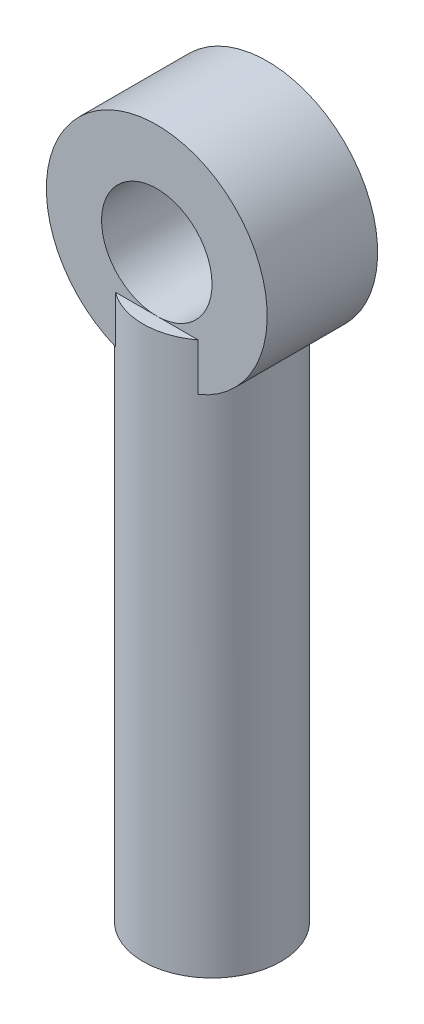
ISO-10303-21;
HEADER;
FILE_DESCRIPTION(('STEP AP214'),'2;1');
FILE_NAME('part.step','',(''),(''),'','','');
FILE_SCHEMA(('AUTOMOTIVE_DESIGN { 1 0 10303 214 1 1 1 1 }'));
ENDSEC;
DATA;
#1=APPLICATION_CONTEXT('core data for automotive mechanical design processes');
#2=APPLICATION_PROTOCOL_DEFINITION('international standard','automotive_design',2000,#1);
#3=PRODUCT_CONTEXT('',#1,'mechanical');
#4=PRODUCT('Part','Part','',(#3));
#5=PRODUCT_RELATED_PRODUCT_CATEGORY('part','',(#4));
#6=PRODUCT_DEFINITION_FORMATION('','',#4);
#7=PRODUCT_DEFINITION_CONTEXT('part definition',#1,'design');
#8=PRODUCT_DEFINITION('design','',#6,#7);
#9=PRODUCT_DEFINITION_SHAPE('','',#8);
#10=(LENGTH_UNIT() NAMED_UNIT(*) SI_UNIT(.MILLI.,.METRE.));
#11=(NAMED_UNIT(*) PLANE_ANGLE_UNIT() SI_UNIT($,.RADIAN.));
#12=(NAMED_UNIT(*) SI_UNIT($,.STERADIAN.) SOLID_ANGLE_UNIT());
#13=UNCERTAINTY_MEASURE_WITH_UNIT(LENGTH_MEASURE(1.E-05),#10,'distance_accuracy_value','');
#14=(GEOMETRIC_REPRESENTATION_CONTEXT(3) GLOBAL_UNCERTAINTY_ASSIGNED_CONTEXT((#13)) GLOBAL_UNIT_ASSIGNED_CONTEXT((#10,
#11,#12)) REPRESENTATION_CONTEXT('',''));
#15=CARTESIAN_POINT('',(0.,0.,0.));
#16=DIRECTION('',(0.,0.,1.));
#17=DIRECTION('',(1.,0.,0.));
#18=AXIS2_PLACEMENT_3D('',#15,#16,#17);
#19=CARTESIAN_POINT('',(0.,12.7,0.));
#20=DIRECTION('',(0.,1.,0.));
#21=DIRECTION('',(0.,0.,1.));
#22=AXIS2_PLACEMENT_3D('',#19,#20,#21);
#23=PLANE('',#22);
#24=CARTESIAN_POINT('',(0.,12.7,0.));
#25=DIRECTION('',(0.,1.,0.));
#26=DIRECTION('',(0.,0.,1.));
#27=AXIS2_PLACEMENT_3D('',#24,#25,#26);
#28=CIRCLE('',#27,1.5875);
#29=CARTESIAN_POINT('',(0.952500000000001,12.7,-1.27));
#30=VERTEX_POINT('',#29);
#31=CARTESIAN_POINT('',(-0.952500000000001,12.7,-1.27));
#32=VERTEX_POINT('',#31);
#33=EDGE_CURVE('E121',#30,#32,#28,.T.);
#34=ORIENTED_EDGE('',*,*,#33,.T.);
#35=DIRECTION('',(1.,0.,0.));
#36=VECTOR('',#35,1.);
#37=CARTESIAN_POINT('',(0.,12.7,-1.27));
#38=LINE('',#37,#36);
#39=CARTESIAN_POINT('',(0.,12.7,-1.27));
#40=VERTEX_POINT('',#39);
#41=EDGE_CURVE('E93',#32,#40,#38,.T.);
#42=ORIENTED_EDGE('',*,*,#41,.T.);
#43=EDGE_CURVE('E122',#40,#30,#38,.T.);
#44=ORIENTED_EDGE('',*,*,#43,.T.);
#45=EDGE_LOOP('',(#34,#42,#44));
#46=FACE_BOUND('',#45,.T.);
#47=ADVANCED_FACE('F34',(#46),#23,.T.);
#48=CARTESIAN_POINT('',(0.,12.7,0.));
#49=DIRECTION('',(0.,-1.,0.));
#50=DIRECTION('',(0.,0.,-1.));
#51=AXIS2_PLACEMENT_3D('',#48,#49,#50);
#52=CYLINDRICAL_SURFACE('',#51,1.5875);
#53=CARTESIAN_POINT('',(0.952500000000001,11.6153569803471,1.27));
#54=CARTESIAN_POINT('',(0.989655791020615,11.6303856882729,1.2421256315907));
#55=CARTESIAN_POINT('',(1.02544534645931,11.6458888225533,1.21274252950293));
#56=CARTESIAN_POINT('',(1.09419094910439,11.6774519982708,1.15110327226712));
#57=CARTESIAN_POINT('',(1.12714713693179,11.6935120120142,1.11884725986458));
#58=CARTESIAN_POINT('',(1.22215858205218,11.7422182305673,1.01740645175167));
#59=CARTESIAN_POINT('',(1.27971680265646,11.7751199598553,0.944030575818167));
#60=CARTESIAN_POINT('',(1.38170319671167,11.8378436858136,0.787289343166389));
#61=CARTESIAN_POINT('',(1.42610923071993,11.8676604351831,0.703907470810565));
#62=CARTESIAN_POINT('',(1.49983096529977,11.9195966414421,0.528772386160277));
#63=CARTESIAN_POINT('',(1.52921852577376,11.9417525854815,0.437061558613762));
#64=CARTESIAN_POINT('',(1.56528116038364,11.9695348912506,0.273853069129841));
#65=CARTESIAN_POINT('',(1.57597885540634,11.9780307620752,0.203728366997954));
#66=CARTESIAN_POINT('',(1.58786748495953,11.9874911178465,0.0621688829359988));
#67=CARTESIAN_POINT('',(1.5890636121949,11.9884597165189,-0.00926516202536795));
#68=CARTESIAN_POINT('',(1.58187506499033,11.9827183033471,-0.151274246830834));
#69=CARTESIAN_POINT('',(1.57349588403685,11.9760126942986,-0.221849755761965));
#70=CARTESIAN_POINT('',(1.54767109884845,11.9559058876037,-0.360337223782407));
#71=CARTESIAN_POINT('',(1.53021845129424,11.9424994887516,-0.428247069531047));
#72=CARTESIAN_POINT('',(1.48616804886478,11.9099813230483,-0.562735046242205));
#73=CARTESIAN_POINT('',(1.45923066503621,11.8906617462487,-0.629149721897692));
#74=CARTESIAN_POINT('',(1.39724824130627,11.8485135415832,-0.756907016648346));
#75=CARTESIAN_POINT('',(1.36219388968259,11.8256808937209,-0.818243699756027));
#76=CARTESIAN_POINT('',(1.27324561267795,11.7713904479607,-0.952491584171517));
#77=CARTESIAN_POINT('',(1.21684063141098,11.7393644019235,-1.02353478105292));
#78=CARTESIAN_POINT('',(1.12383524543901,11.6918843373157,-1.12213659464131));
#79=CARTESIAN_POINT('',(1.09145737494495,11.6761607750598,-1.15365893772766));
#80=CARTESIAN_POINT('',(1.0239904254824,11.6452592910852,-1.21393596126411));
#81=CARTESIAN_POINT('',(0.988901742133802,11.6300812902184,-1.2426910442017));
#82=CARTESIAN_POINT('',(0.952500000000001,11.6153569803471,-1.27));
#83=B_SPLINE_CURVE_WITH_KNOTS('',3,(#53,#54,#55,#56,#57,#58,#59,#60,#61,#62,#63,#64,#65,#66,#67,
#68,#69,#70,#71,#72,#73,#74,#75,#76,#77,#78,#79,#80,#81,#82),.UNSPECIFIED.,.F.,.F.,(4,2,2,2,2,2,
2,2,2,2,2,2,2,2,4),(0.,0.146355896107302,0.292704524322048,0.587907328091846,0.883604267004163,
1.1778727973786,1.39125693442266,1.60452444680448,1.81766966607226,2.03098058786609,
2.25287211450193,2.47501946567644,2.76219802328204,2.90560249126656,3.04898606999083),.UNSPECIFIED.);
#84=CARTESIAN_POINT('',(0.952500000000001,11.6153569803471,1.27));
#85=VERTEX_POINT('',#84);
#86=CARTESIAN_POINT('',(0.952500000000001,11.6153569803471,-1.27));
#87=VERTEX_POINT('',#86);
#88=EDGE_CURVE('E11',#85,#87,#83,.T.);
#89=ORIENTED_EDGE('',*,*,#88,.F.);
#90=DIRECTION('',(0.,-1.,0.));
#91=VECTOR('',#90,1.);
#92=CARTESIAN_POINT('',(0.952500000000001,12.7,1.27));
#93=LINE('',#92,#91);
#94=CARTESIAN_POINT('',(0.952500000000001,12.7,1.27));
#95=VERTEX_POINT('',#94);
#96=EDGE_CURVE('E112',#85,#95,#93,.F.);
#97=ORIENTED_EDGE('',*,*,#96,.T.);
#98=CARTESIAN_POINT('',(-0.952500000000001,12.7,1.27));
#99=VERTEX_POINT('',#98);
#100=EDGE_CURVE('E119',#99,#95,#28,.T.);
#101=ORIENTED_EDGE('',*,*,#100,.F.);
#102=DIRECTION('',(0.,-1.,0.));
#103=VECTOR('',#102,1.);
#104=CARTESIAN_POINT('',(-0.952500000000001,12.7,1.27));
#105=LINE('',#104,#103);
#106=CARTESIAN_POINT('',(-0.952500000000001,11.6153569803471,1.27));
#107=VERTEX_POINT('',#106);
#108=EDGE_CURVE('E62',#99,#107,#105,.T.);
#109=ORIENTED_EDGE('',*,*,#108,.T.);
#110=CARTESIAN_POINT('',(-0.952500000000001,11.6153569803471,-1.27));
#111=CARTESIAN_POINT('',(-0.989655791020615,11.6303856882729,-1.2421256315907));
#112=CARTESIAN_POINT('',(-1.02544534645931,11.6458888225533,-1.21274252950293));
#113=CARTESIAN_POINT('',(-1.09419094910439,11.6774519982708,-1.15110327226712));
#114=CARTESIAN_POINT('',(-1.12714713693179,11.6935120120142,-1.11884725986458));
#115=CARTESIAN_POINT('',(-1.22215858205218,11.7422182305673,-1.01740645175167));
#116=CARTESIAN_POINT('',(-1.27971680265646,11.7751199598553,-0.944030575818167));
#117=CARTESIAN_POINT('',(-1.38170319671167,11.8378436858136,-0.787289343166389));
#118=CARTESIAN_POINT('',(-1.42610923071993,11.8676604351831,-0.703907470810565));
#119=CARTESIAN_POINT('',(-1.49983096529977,11.9195966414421,-0.528772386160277));
#120=CARTESIAN_POINT('',(-1.52921852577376,11.9417525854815,-0.437061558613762));
#121=CARTESIAN_POINT('',(-1.56528116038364,11.9695348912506,-0.273853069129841));
#122=CARTESIAN_POINT('',(-1.57597885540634,11.9780307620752,-0.203728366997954));
#123=CARTESIAN_POINT('',(-1.58786748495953,11.9874911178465,-0.0621688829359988));
#124=CARTESIAN_POINT('',(-1.5890636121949,11.9884597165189,0.00926516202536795));
#125=CARTESIAN_POINT('',(-1.58187506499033,11.9827183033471,0.151274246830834));
#126=CARTESIAN_POINT('',(-1.57349588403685,11.9760126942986,0.221849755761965));
#127=CARTESIAN_POINT('',(-1.54767109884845,11.9559058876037,0.360337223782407));
#128=CARTESIAN_POINT('',(-1.53021845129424,11.9424994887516,0.428247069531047));
#129=CARTESIAN_POINT('',(-1.48616804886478,11.9099813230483,0.562735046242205));
#130=CARTESIAN_POINT('',(-1.45923066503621,11.8906617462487,0.629149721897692));
#131=CARTESIAN_POINT('',(-1.39724824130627,11.8485135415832,0.756907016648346));
#132=CARTESIAN_POINT('',(-1.36219388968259,11.8256808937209,0.818243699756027));
#133=CARTESIAN_POINT('',(-1.27324561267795,11.7713904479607,0.952491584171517));
#134=CARTESIAN_POINT('',(-1.21684063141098,11.7393644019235,1.02353478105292));
#135=CARTESIAN_POINT('',(-1.12383524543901,11.6918843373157,1.12213659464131));
#136=CARTESIAN_POINT('',(-1.09145737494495,11.6761607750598,1.15365893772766));
#137=CARTESIAN_POINT('',(-1.0239904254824,11.6452592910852,1.21393596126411));
#138=CARTESIAN_POINT('',(-0.988901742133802,11.6300812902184,1.2426910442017));
#139=CARTESIAN_POINT('',(-0.952500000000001,11.6153569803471,1.27));
#140=B_SPLINE_CURVE_WITH_KNOTS('',3,(#110,#111,#112,#113,#114,#115,#116,#117,#118,#119,#120,
#121,#122,#123,#124,#125,#126,#127,#128,#129,#130,#131,#132,#133,#134,#135,#136,#137,#138,#139),
.UNSPECIFIED.,.F.,.F.,(4,2,2,2,2,2,2,2,2,2,2,2,2,2,4),(0.,0.146355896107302,0.292704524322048,
0.587907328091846,0.883604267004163,1.1778727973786,1.39125693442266,1.60452444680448,
1.81766966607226,2.03098058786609,2.25287211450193,2.47501946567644,2.76219802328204,
2.90560249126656,3.04898606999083),.UNSPECIFIED.);
#141=CARTESIAN_POINT('',(-0.952500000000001,11.6153569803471,-1.27));
#142=VERTEX_POINT('',#141);
#143=EDGE_CURVE('E47',#142,#107,#140,.T.);
#144=ORIENTED_EDGE('',*,*,#143,.F.);
#145=DIRECTION('',(0.,-1.,0.));
#146=VECTOR('',#145,1.);
#147=CARTESIAN_POINT('',(-0.952500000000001,12.7,-1.27));
#148=LINE('',#147,#146);
#149=EDGE_CURVE('E110',#32,#142,#148,.T.);
#150=ORIENTED_EDGE('',*,*,#149,.F.);
#151=ORIENTED_EDGE('',*,*,#33,.F.);
#152=DIRECTION('',(0.,-1.,0.));
#153=VECTOR('',#152,1.);
#154=CARTESIAN_POINT('',(0.952500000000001,12.7,-1.27));
#155=LINE('',#154,#153);
#156=EDGE_CURVE('E54',#87,#30,#155,.F.);
#157=ORIENTED_EDGE('',*,*,#156,.F.);
#158=EDGE_LOOP('',(#89,#97,#101,#109,#144,#150,#151,#157));
#159=FACE_BOUND('',#158,.T.);
#160=CARTESIAN_POINT('',(0.,0.,0.));
#161=DIRECTION('',(0.,1.,0.));
#162=DIRECTION('',(0.,0.,1.));
#163=AXIS2_PLACEMENT_3D('',#160,#161,#162);
#164=CIRCLE('',#163,1.5875);
#165=CARTESIAN_POINT('',(0.,0.,1.5875));
#166=VERTEX_POINT('',#165);
#167=EDGE_CURVE('E116',#166,#166,#164,.T.);
#168=ORIENTED_EDGE('',*,*,#167,.T.);
#169=EDGE_LOOP('',(#168));
#170=FACE_BOUND('',#169,.T.);
#171=ADVANCED_FACE('F36',(#159,#170),#52,.T.);
#172=DIRECTION('',(1.,0.,0.));
#173=VECTOR('',#172,1.);
#174=CARTESIAN_POINT('',(0.,12.7,1.27));
#175=LINE('',#174,#173);
#176=CARTESIAN_POINT('',(0.,12.7,1.27));
#177=VERTEX_POINT('',#176);
#178=EDGE_CURVE('E85',#99,#177,#175,.T.);
#179=ORIENTED_EDGE('',*,*,#178,.F.);
#180=ORIENTED_EDGE('',*,*,#100,.T.);
#181=EDGE_CURVE('E95',#177,#95,#175,.T.);
#182=ORIENTED_EDGE('',*,*,#181,.F.);
#183=EDGE_LOOP('',(#179,#180,#182));
#184=FACE_BOUND('',#183,.T.);
#185=ADVANCED_FACE('F136',(#184),#23,.T.);
#186=CARTESIAN_POINT('',(0.,0.,0.));
#187=DIRECTION('',(0.,1.,0.));
#188=DIRECTION('',(0.,0.,1.));
#189=AXIS2_PLACEMENT_3D('',#186,#187,#188);
#190=PLANE('',#189);
#191=ORIENTED_EDGE('',*,*,#167,.F.);
#192=EDGE_LOOP('',(#191));
#193=FACE_BOUND('',#192,.T.);
#194=ADVANCED_FACE('F131',(#193),#190,.F.);
#195=CARTESIAN_POINT('',(0.,13.97,1.27));
#196=DIRECTION('',(0.,0.,-1.));
#197=DIRECTION('',(-1.,0.,0.));
#198=AXIS2_PLACEMENT_3D('',#195,#196,#197);
#199=CYLINDRICAL_SURFACE('',#198,2.54);
#200=CARTESIAN_POINT('',(0.,13.97,1.27));
#201=DIRECTION('',(0.,0.,1.));
#202=DIRECTION('',(1.,0.,0.));
#203=AXIS2_PLACEMENT_3D('',#200,#201,#202);
#204=CIRCLE('',#203,2.54);
#205=EDGE_CURVE('E103',#85,#107,#204,.T.);
#206=ORIENTED_EDGE('',*,*,#205,.F.);
#207=ORIENTED_EDGE('',*,*,#88,.T.);
#208=CARTESIAN_POINT('',(0.,13.97,-1.27));
#209=DIRECTION('',(0.,0.,1.));
#210=DIRECTION('',(1.,0.,0.));
#211=AXIS2_PLACEMENT_3D('',#208,#209,#210);
#212=CIRCLE('',#211,2.54);
#213=EDGE_CURVE('E99',#87,#142,#212,.T.);
#214=ORIENTED_EDGE('',*,*,#213,.T.);
#215=ORIENTED_EDGE('',*,*,#143,.T.);
#216=EDGE_LOOP('',(#206,#207,#214,#215));
#217=FACE_BOUND('',#216,.T.);
#218=ADVANCED_FACE('F126',(#217),#199,.T.);
#219=CARTESIAN_POINT('',(0.,13.97,1.27));
#220=DIRECTION('',(0.,0.,1.));
#221=DIRECTION('',(1.,0.,0.));
#222=AXIS2_PLACEMENT_3D('',#219,#220,#221);
#223=PLANE('',#222);
#224=ORIENTED_EDGE('',*,*,#108,.F.);
#225=ORIENTED_EDGE('',*,*,#178,.T.);
#226=CARTESIAN_POINT('',(0.,13.97,1.27));
#227=DIRECTION('',(0.,0.,1.));
#228=DIRECTION('',(1.,0.,0.));
#229=AXIS2_PLACEMENT_3D('',#226,#227,#228);
#230=CIRCLE('',#229,1.27);
#231=EDGE_CURVE('E88',#177,#177,#230,.T.);
#232=ORIENTED_EDGE('',*,*,#231,.F.);
#233=ORIENTED_EDGE('',*,*,#181,.T.);
#234=ORIENTED_EDGE('',*,*,#96,.F.);
#235=ORIENTED_EDGE('',*,*,#205,.T.);
#236=EDGE_LOOP('',(#224,#225,#232,#233,#234,#235));
#237=FACE_BOUND('',#236,.T.);
#238=ADVANCED_FACE('F87',(#237),#223,.T.);
#239=CARTESIAN_POINT('',(0.,13.97,-1.27));
#240=DIRECTION('',(0.,0.,1.));
#241=DIRECTION('',(1.,0.,0.));
#242=AXIS2_PLACEMENT_3D('',#239,#240,#241);
#243=PLANE('',#242);
#244=ORIENTED_EDGE('',*,*,#41,.F.);
#245=ORIENTED_EDGE('',*,*,#149,.T.);
#246=ORIENTED_EDGE('',*,*,#213,.F.);
#247=ORIENTED_EDGE('',*,*,#156,.T.);
#248=ORIENTED_EDGE('',*,*,#43,.F.);
#249=CARTESIAN_POINT('',(0.,13.97,-1.27));
#250=DIRECTION('',(0.,0.,1.));
#251=DIRECTION('',(1.,0.,0.));
#252=AXIS2_PLACEMENT_3D('',#249,#250,#251);
#253=CIRCLE('',#252,1.27);
#254=EDGE_CURVE('E100',#40,#40,#253,.T.);
#255=ORIENTED_EDGE('',*,*,#254,.T.);
#256=EDGE_LOOP('',(#244,#245,#246,#247,#248,#255));
#257=FACE_BOUND('',#256,.T.);
#258=ADVANCED_FACE('F154',(#257),#243,.F.);
#259=CARTESIAN_POINT('',(0.,13.97,1.27));
#260=DIRECTION('',(0.,0.,-1.));
#261=DIRECTION('',(-1.,0.,0.));
#262=AXIS2_PLACEMENT_3D('',#259,#260,#261);
#263=CYLINDRICAL_SURFACE('',#262,1.27);
#264=ORIENTED_EDGE('',*,*,#231,.T.);
#265=EDGE_LOOP('',(#264));
#266=FACE_BOUND('',#265,.T.);
#267=ORIENTED_EDGE('',*,*,#254,.F.);
#268=EDGE_LOOP('',(#267));
#269=FACE_BOUND('',#268,.T.);
#270=ADVANCED_FACE('F97',(#266,#269),#263,.F.);
#271=CLOSED_SHELL('',(#47,#171,#185,#194,#218,#238,#258,#270));
#272=MANIFOLD_SOLID_BREP('B2',#271);
#273=ADVANCED_BREP_SHAPE_REPRESENTATION('',(#18,#272),#14);
#274=SHAPE_DEFINITION_REPRESENTATION(#9,#273);
ENDSEC;
END-ISO-10303-21;
